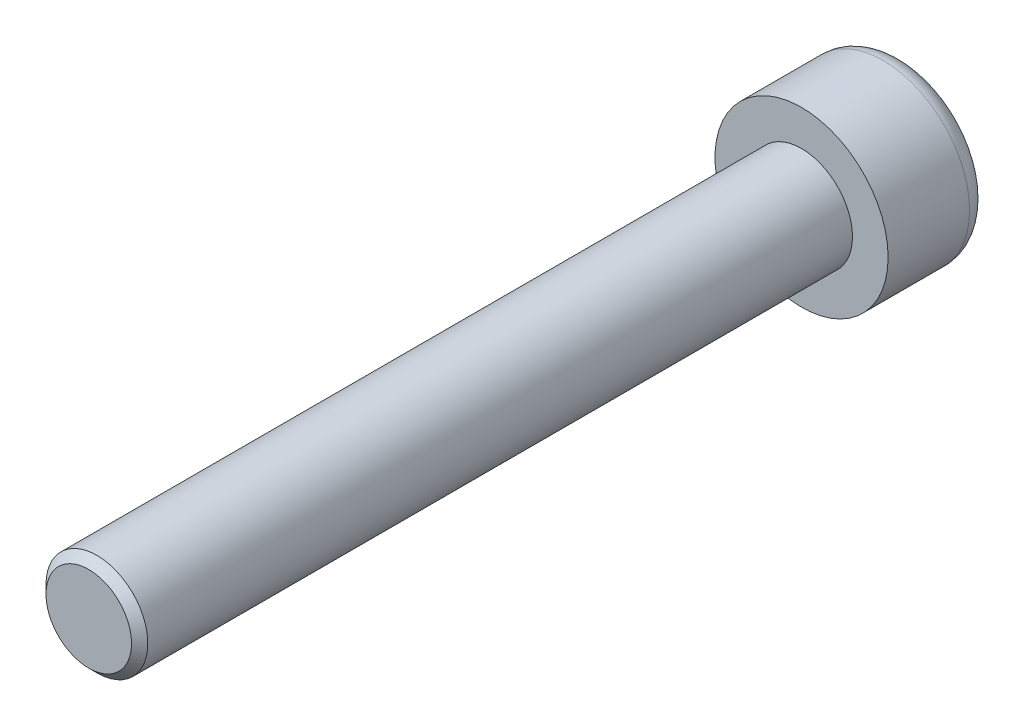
ISO-10303-21;
HEADER;
FILE_DESCRIPTION(('STEP AP214'),'2;1');
FILE_NAME('part.step','',(''),(''),'','','');
FILE_SCHEMA(('AUTOMOTIVE_DESIGN { 1 0 10303 214 1 1 1 1 }'));
ENDSEC;
DATA;
#1=APPLICATION_CONTEXT('core data for automotive mechanical design processes');
#2=APPLICATION_PROTOCOL_DEFINITION('international standard','automotive_design',2000,#1);
#3=PRODUCT_CONTEXT('',#1,'mechanical');
#4=PRODUCT('Part','Part','',(#3));
#5=PRODUCT_RELATED_PRODUCT_CATEGORY('part','',(#4));
#6=PRODUCT_DEFINITION_FORMATION('','',#4);
#7=PRODUCT_DEFINITION_CONTEXT('part definition',#1,'design');
#8=PRODUCT_DEFINITION('design','',#6,#7);
#9=PRODUCT_DEFINITION_SHAPE('','',#8);
#10=(LENGTH_UNIT() NAMED_UNIT(*) SI_UNIT(.MILLI.,.METRE.));
#11=(NAMED_UNIT(*) PLANE_ANGLE_UNIT() SI_UNIT($,.RADIAN.));
#12=(NAMED_UNIT(*) SI_UNIT($,.STERADIAN.) SOLID_ANGLE_UNIT());
#13=UNCERTAINTY_MEASURE_WITH_UNIT(LENGTH_MEASURE(1.E-05),#10,'distance_accuracy_value','');
#14=(GEOMETRIC_REPRESENTATION_CONTEXT(3) GLOBAL_UNCERTAINTY_ASSIGNED_CONTEXT((#13)) GLOBAL_UNIT_ASSIGNED_CONTEXT((#10,
#11,#12)) REPRESENTATION_CONTEXT('',''));
#15=CARTESIAN_POINT('',(0.,0.,0.));
#16=DIRECTION('',(0.,0.,1.));
#17=DIRECTION('',(1.,0.,0.));
#18=AXIS2_PLACEMENT_3D('',#15,#16,#17);
#19=CARTESIAN_POINT('',(0.,0.,5.));
#20=DIRECTION('',(0.,0.,1.));
#21=DIRECTION('',(1.,0.,0.));
#22=AXIS2_PLACEMENT_3D('',#19,#20,#21);
#23=PLANE('',#22);
#24=CARTESIAN_POINT('',(0.,0.,5.));
#25=DIRECTION('',(0.,0.,1.));
#26=DIRECTION('',(1.,0.,0.));
#27=AXIS2_PLACEMENT_3D('',#24,#25,#26);
#28=CIRCLE('',#27,4.25);
#29=CARTESIAN_POINT('',(4.25,0.,5.));
#30=VERTEX_POINT('',#29);
#31=EDGE_CURVE('E136',#30,#30,#28,.T.);
#32=ORIENTED_EDGE('',*,*,#31,.T.);
#33=EDGE_LOOP('',(#32));
#34=FACE_BOUND('',#33,.T.);
#35=CARTESIAN_POINT('',(0.,0.,5.));
#36=DIRECTION('',(0.,0.,1.));
#37=DIRECTION('',(1.,0.,0.));
#38=AXIS2_PLACEMENT_3D('',#35,#36,#37);
#39=CIRCLE('',#38,2.5);
#40=CARTESIAN_POINT('',(2.5,0.,5.));
#41=VERTEX_POINT('',#40);
#42=EDGE_CURVE('E195',#41,#41,#39,.T.);
#43=ORIENTED_EDGE('',*,*,#42,.F.);
#44=EDGE_LOOP('',(#43));
#45=FACE_BOUND('',#44,.T.);
#46=ADVANCED_FACE('F34',(#34,#45),#23,.T.);
#47=CARTESIAN_POINT('',(0.,0.,5.));
#48=DIRECTION('',(0.,0.,-1.));
#49=DIRECTION('',(-1.,0.,0.));
#50=AXIS2_PLACEMENT_3D('',#47,#48,#49);
#51=CYLINDRICAL_SURFACE('',#50,4.25);
#52=CARTESIAN_POINT('',(0.,0.,1.));
#53=DIRECTION('',(0.,0.,1.));
#54=DIRECTION('',(1.,0.,0.));
#55=AXIS2_PLACEMENT_3D('',#52,#53,#54);
#56=CIRCLE('',#55,4.25);
#57=CARTESIAN_POINT('',(4.25,0.,1.));
#58=VERTEX_POINT('',#57);
#59=EDGE_CURVE('E42',#58,#58,#56,.T.);
#60=ORIENTED_EDGE('',*,*,#59,.T.);
#61=EDGE_LOOP('',(#60));
#62=FACE_BOUND('',#61,.T.);
#63=ORIENTED_EDGE('',*,*,#31,.F.);
#64=EDGE_LOOP('',(#63));
#65=FACE_BOUND('',#64,.T.);
#66=ADVANCED_FACE('F36',(#62,#65),#51,.T.);
#67=CARTESIAN_POINT('',(0.,0.,0.));
#68=DIRECTION('',(0.,0.,1.));
#69=DIRECTION('',(1.,0.,0.));
#70=AXIS2_PLACEMENT_3D('',#67,#68,#69);
#71=PLANE('',#70);
#72=CARTESIAN_POINT('',(0.,0.,0.));
#73=DIRECTION('',(0.,0.,1.));
#74=DIRECTION('',(1.,0.,0.));
#75=AXIS2_PLACEMENT_3D('',#72,#73,#74);
#76=CIRCLE('',#75,3.25);
#77=CARTESIAN_POINT('',(3.25,0.,0.));
#78=VERTEX_POINT('',#77);
#79=EDGE_CURVE('E11',#78,#78,#76,.F.);
#80=ORIENTED_EDGE('',*,*,#79,.T.);
#81=EDGE_LOOP('',(#80));
#82=FACE_BOUND('',#81,.T.);
#83=DIRECTION('',(0.866025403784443,-0.499999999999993,0.));
#84=VECTOR('',#83,1.);
#85=CARTESIAN_POINT('',(0.,2.30940107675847,0.));
#86=LINE('',#85,#84);
#87=CARTESIAN_POINT('',(0.,2.30940107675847,0.));
#88=VERTEX_POINT('',#87);
#89=CARTESIAN_POINT('',(2.,1.15470053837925,0.));
#90=VERTEX_POINT('',#89);
#91=EDGE_CURVE('E103',#88,#90,#86,.T.);
#92=ORIENTED_EDGE('',*,*,#91,.F.);
#93=DIRECTION('',(0.866025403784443,0.499999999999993,0.));
#94=VECTOR('',#93,1.);
#95=CARTESIAN_POINT('',(0.,2.30940107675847,0.));
#96=LINE('',#95,#94);
#97=CARTESIAN_POINT('',(-2.,1.15470053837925,0.));
#98=VERTEX_POINT('',#97);
#99=EDGE_CURVE('E49',#98,#88,#96,.T.);
#100=ORIENTED_EDGE('',*,*,#99,.F.);
#101=DIRECTION('',(0.,1.,0.));
#102=VECTOR('',#101,1.);
#103=CARTESIAN_POINT('',(-2.,1.15470053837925,0.));
#104=LINE('',#103,#102);
#105=CARTESIAN_POINT('',(-2.,-1.15470053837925,0.));
#106=VERTEX_POINT('',#105);
#107=EDGE_CURVE('E118',#106,#98,#104,.T.);
#108=ORIENTED_EDGE('',*,*,#107,.F.);
#109=DIRECTION('',(-0.866025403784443,0.499999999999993,0.));
#110=VECTOR('',#109,1.);
#111=CARTESIAN_POINT('',(-2.,-1.15470053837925,0.));
#112=LINE('',#111,#110);
#113=CARTESIAN_POINT('',(0.,-2.30940107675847,0.));
#114=VERTEX_POINT('',#113);
#115=EDGE_CURVE('E112',#114,#106,#112,.T.);
#116=ORIENTED_EDGE('',*,*,#115,.F.);
#117=DIRECTION('',(-0.866025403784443,-0.499999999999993,0.));
#118=VECTOR('',#117,1.);
#119=CARTESIAN_POINT('',(2.,-1.15470053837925,0.));
#120=LINE('',#119,#118);
#121=CARTESIAN_POINT('',(2.,-1.15470053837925,0.));
#122=VERTEX_POINT('',#121);
#123=EDGE_CURVE('E110',#122,#114,#120,.T.);
#124=ORIENTED_EDGE('',*,*,#123,.F.);
#125=DIRECTION('',(0.,-1.,0.));
#126=VECTOR('',#125,1.);
#127=CARTESIAN_POINT('',(2.,1.15470053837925,0.));
#128=LINE('',#127,#126);
#129=EDGE_CURVE('E92',#90,#122,#128,.T.);
#130=ORIENTED_EDGE('',*,*,#129,.F.);
#131=EDGE_LOOP('',(#92,#100,#108,#116,#124,#130));
#132=FACE_BOUND('',#131,.T.);
#133=ADVANCED_FACE('F107',(#82,#132),#71,.F.);
#134=CARTESIAN_POINT('',(0.,2.30940107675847,3.125));
#135=DIRECTION('',(-0.499999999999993,0.866025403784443,0.));
#136=DIRECTION('',(-0.866025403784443,-0.499999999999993,0.));
#137=AXIS2_PLACEMENT_3D('',#134,#135,#136);
#138=PLANE('',#137);
#139=ORIENTED_EDGE('',*,*,#99,.T.);
#140=DIRECTION('',(0.,0.,-1.));
#141=VECTOR('',#140,1.);
#142=CARTESIAN_POINT('',(0.,2.30940107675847,3.125));
#143=LINE('',#142,#141);
#144=CARTESIAN_POINT('',(0.,2.30940107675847,3.125));
#145=VERTEX_POINT('',#144);
#146=EDGE_CURVE('E100',#145,#88,#143,.T.);
#147=ORIENTED_EDGE('',*,*,#146,.F.);
#148=DIRECTION('',(0.866025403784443,0.499999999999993,0.));
#149=VECTOR('',#148,1.);
#150=CARTESIAN_POINT('',(0.,2.30940107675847,3.125));
#151=LINE('',#150,#149);
#152=CARTESIAN_POINT('',(-2.,1.15470053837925,3.125));
#153=VERTEX_POINT('',#152);
#154=EDGE_CURVE('E120',#153,#145,#151,.T.);
#155=ORIENTED_EDGE('',*,*,#154,.F.);
#156=DIRECTION('',(0.,0.,-1.));
#157=VECTOR('',#156,1.);
#158=CARTESIAN_POINT('',(-2.,1.15470053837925,3.125));
#159=LINE('',#158,#157);
#160=EDGE_CURVE('E56',#153,#98,#159,.T.);
#161=ORIENTED_EDGE('',*,*,#160,.T.);
#162=EDGE_LOOP('',(#139,#147,#155,#161));
#163=FACE_BOUND('',#162,.T.);
#164=ADVANCED_FACE('F174',(#163),#138,.F.);
#165=CARTESIAN_POINT('',(-2.,1.15470053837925,3.125));
#166=DIRECTION('',(-1.,0.,0.));
#167=DIRECTION('',(0.,0.,1.));
#168=AXIS2_PLACEMENT_3D('',#165,#166,#167);
#169=PLANE('',#168);
#170=ORIENTED_EDGE('',*,*,#107,.T.);
#171=ORIENTED_EDGE('',*,*,#160,.F.);
#172=DIRECTION('',(0.,1.,0.));
#173=VECTOR('',#172,1.);
#174=CARTESIAN_POINT('',(-2.,1.15470053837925,3.125));
#175=LINE('',#174,#173);
#176=CARTESIAN_POINT('',(-2.,-1.15470053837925,3.125));
#177=VERTEX_POINT('',#176);
#178=EDGE_CURVE('E132',#177,#153,#175,.T.);
#179=ORIENTED_EDGE('',*,*,#178,.F.);
#180=DIRECTION('',(0.,0.,-1.));
#181=VECTOR('',#180,1.);
#182=CARTESIAN_POINT('',(-2.,-1.15470053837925,3.125));
#183=LINE('',#182,#181);
#184=EDGE_CURVE('E137',#177,#106,#183,.T.);
#185=ORIENTED_EDGE('',*,*,#184,.T.);
#186=EDGE_LOOP('',(#170,#171,#179,#185));
#187=FACE_BOUND('',#186,.T.);
#188=ADVANCED_FACE('F178',(#187),#169,.F.);
#189=CARTESIAN_POINT('',(-2.,-1.15470053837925,3.125));
#190=DIRECTION('',(-0.499999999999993,-0.866025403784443,0.));
#191=DIRECTION('',(0.866025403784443,-0.499999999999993,0.));
#192=AXIS2_PLACEMENT_3D('',#189,#190,#191);
#193=PLANE('',#192);
#194=ORIENTED_EDGE('',*,*,#115,.T.);
#195=ORIENTED_EDGE('',*,*,#184,.F.);
#196=DIRECTION('',(-0.866025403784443,0.499999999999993,0.));
#197=VECTOR('',#196,1.);
#198=CARTESIAN_POINT('',(-2.,-1.15470053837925,3.125));
#199=LINE('',#198,#197);
#200=CARTESIAN_POINT('',(0.,-2.30940107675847,3.125));
#201=VERTEX_POINT('',#200);
#202=EDGE_CURVE('E129',#201,#177,#199,.T.);
#203=ORIENTED_EDGE('',*,*,#202,.F.);
#204=DIRECTION('',(0.,0.,-1.));
#205=VECTOR('',#204,1.);
#206=CARTESIAN_POINT('',(0.,-2.30940107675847,3.125));
#207=LINE('',#206,#205);
#208=EDGE_CURVE('E139',#201,#114,#207,.T.);
#209=ORIENTED_EDGE('',*,*,#208,.T.);
#210=EDGE_LOOP('',(#194,#195,#203,#209));
#211=FACE_BOUND('',#210,.T.);
#212=ADVANCED_FACE('F186',(#211),#193,.F.);
#213=CARTESIAN_POINT('',(2.,-1.15470053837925,3.125));
#214=DIRECTION('',(0.499999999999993,-0.866025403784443,0.));
#215=DIRECTION('',(0.866025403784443,0.499999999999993,0.));
#216=AXIS2_PLACEMENT_3D('',#213,#214,#215);
#217=PLANE('',#216);
#218=ORIENTED_EDGE('',*,*,#123,.T.);
#219=ORIENTED_EDGE('',*,*,#208,.F.);
#220=DIRECTION('',(-0.866025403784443,-0.499999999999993,0.));
#221=VECTOR('',#220,1.);
#222=CARTESIAN_POINT('',(2.,-1.15470053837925,3.125));
#223=LINE('',#222,#221);
#224=CARTESIAN_POINT('',(2.,-1.15470053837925,3.125));
#225=VERTEX_POINT('',#224);
#226=EDGE_CURVE('E126',#225,#201,#223,.T.);
#227=ORIENTED_EDGE('',*,*,#226,.F.);
#228=DIRECTION('',(0.,0.,-1.));
#229=VECTOR('',#228,1.);
#230=CARTESIAN_POINT('',(2.,-1.15470053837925,3.125));
#231=LINE('',#230,#229);
#232=EDGE_CURVE('E99',#225,#122,#231,.T.);
#233=ORIENTED_EDGE('',*,*,#232,.T.);
#234=EDGE_LOOP('',(#218,#219,#227,#233));
#235=FACE_BOUND('',#234,.T.);
#236=ADVANCED_FACE('F183',(#235),#217,.F.);
#237=CARTESIAN_POINT('',(2.,1.15470053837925,3.125));
#238=DIRECTION('',(1.,0.,0.));
#239=DIRECTION('',(0.,0.,-1.));
#240=AXIS2_PLACEMENT_3D('',#237,#238,#239);
#241=PLANE('',#240);
#242=ORIENTED_EDGE('',*,*,#129,.T.);
#243=ORIENTED_EDGE('',*,*,#232,.F.);
#244=DIRECTION('',(0.,-1.,0.));
#245=VECTOR('',#244,1.);
#246=CARTESIAN_POINT('',(2.,1.15470053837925,3.125));
#247=LINE('',#246,#245);
#248=CARTESIAN_POINT('',(2.,1.15470053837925,3.125));
#249=VERTEX_POINT('',#248);
#250=EDGE_CURVE('E95',#249,#225,#247,.T.);
#251=ORIENTED_EDGE('',*,*,#250,.F.);
#252=DIRECTION('',(0.,0.,-1.));
#253=VECTOR('',#252,1.);
#254=CARTESIAN_POINT('',(2.,1.15470053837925,3.125));
#255=LINE('',#254,#253);
#256=EDGE_CURVE('E88',#249,#90,#255,.T.);
#257=ORIENTED_EDGE('',*,*,#256,.T.);
#258=EDGE_LOOP('',(#242,#243,#251,#257));
#259=FACE_BOUND('',#258,.T.);
#260=ADVANCED_FACE('F90',(#259),#241,.F.);
#261=CARTESIAN_POINT('',(0.,2.30940107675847,3.125));
#262=DIRECTION('',(0.499999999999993,0.866025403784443,0.));
#263=DIRECTION('',(-0.866025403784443,0.499999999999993,0.));
#264=AXIS2_PLACEMENT_3D('',#261,#262,#263);
#265=PLANE('',#264);
#266=ORIENTED_EDGE('',*,*,#91,.T.);
#267=ORIENTED_EDGE('',*,*,#256,.F.);
#268=DIRECTION('',(0.866025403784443,-0.499999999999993,0.));
#269=VECTOR('',#268,1.);
#270=CARTESIAN_POINT('',(0.,2.30940107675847,3.125));
#271=LINE('',#270,#269);
#272=EDGE_CURVE('E123',#145,#249,#271,.T.);
#273=ORIENTED_EDGE('',*,*,#272,.F.);
#274=ORIENTED_EDGE('',*,*,#146,.T.);
#275=EDGE_LOOP('',(#266,#267,#273,#274));
#276=FACE_BOUND('',#275,.T.);
#277=ADVANCED_FACE('F104',(#276),#265,.F.);
#278=CARTESIAN_POINT('',(-2.,1.15470053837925,3.125));
#279=DIRECTION('',(0.,0.,1.));
#280=DIRECTION('',(1.,0.,0.));
#281=AXIS2_PLACEMENT_3D('',#278,#279,#280);
#282=PLANE('',#281);
#283=ORIENTED_EDGE('',*,*,#154,.T.);
#284=ORIENTED_EDGE('',*,*,#272,.T.);
#285=ORIENTED_EDGE('',*,*,#250,.T.);
#286=ORIENTED_EDGE('',*,*,#226,.T.);
#287=ORIENTED_EDGE('',*,*,#202,.T.);
#288=ORIENTED_EDGE('',*,*,#178,.T.);
#289=EDGE_LOOP('',(#283,#284,#285,#286,#287,#288));
#290=FACE_BOUND('',#289,.T.);
#291=ADVANCED_FACE('F152',(#290),#282,.F.);
#292=CARTESIAN_POINT('',(0.,0.,1.));
#293=DIRECTION('',(0.,0.,1.));
#294=DIRECTION('',(1.,0.,0.));
#295=AXIS2_PLACEMENT_3D('',#292,#293,#294);
#296=TOROIDAL_SURFACE('',#295,3.25,1.);
#297=ORIENTED_EDGE('',*,*,#79,.F.);
#298=EDGE_LOOP('',(#297));
#299=FACE_BOUND('',#298,.T.);
#300=ORIENTED_EDGE('',*,*,#59,.F.);
#301=EDGE_LOOP('',(#300));
#302=FACE_BOUND('',#301,.T.);
#303=ADVANCED_FACE('F149',(#299,#302),#296,.T.);
#304=CARTESIAN_POINT('',(0.,0.,40.));
#305=DIRECTION('',(0.,0.,-1.));
#306=DIRECTION('',(-1.,0.,0.));
#307=AXIS2_PLACEMENT_3D('',#304,#305,#306);
#308=CYLINDRICAL_SURFACE('',#307,2.5);
#309=CARTESIAN_POINT('',(0.,0.,39.6));
#310=DIRECTION('',(0.,0.,-1.));
#311=DIRECTION('',(-1.,0.,0.));
#312=AXIS2_PLACEMENT_3D('',#309,#310,#311);
#313=CIRCLE('',#312,2.5);
#314=CARTESIAN_POINT('',(-2.5,0.,39.6));
#315=VERTEX_POINT('',#314);
#316=EDGE_CURVE('E202',#315,#315,#313,.T.);
#317=ORIENTED_EDGE('',*,*,#316,.T.);
#318=EDGE_LOOP('',(#317));
#319=FACE_BOUND('',#318,.T.);
#320=ORIENTED_EDGE('',*,*,#42,.T.);
#321=EDGE_LOOP('',(#320));
#322=FACE_BOUND('',#321,.T.);
#323=ADVANCED_FACE('F151',(#319,#322),#308,.T.);
#324=CARTESIAN_POINT('',(0.,0.,40.));
#325=DIRECTION('',(0.,0.,-1.));
#326=DIRECTION('',(-1.,0.,0.));
#327=AXIS2_PLACEMENT_3D('',#324,#325,#326);
#328=CONICAL_SURFACE('',#327,2.1,0.785398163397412);
#329=ORIENTED_EDGE('',*,*,#316,.F.);
#330=EDGE_LOOP('',(#329));
#331=FACE_BOUND('',#330,.T.);
#332=CARTESIAN_POINT('',(0.,0.,40.));
#333=DIRECTION('',(0.,0.,-1.));
#334=DIRECTION('',(-1.,0.,0.));
#335=AXIS2_PLACEMENT_3D('',#332,#333,#334);
#336=CIRCLE('',#335,2.1);
#337=CARTESIAN_POINT('',(-2.1,0.,40.));
#338=VERTEX_POINT('',#337);
#339=EDGE_CURVE('E197',#338,#338,#336,.T.);
#340=ORIENTED_EDGE('',*,*,#339,.T.);
#341=EDGE_LOOP('',(#340));
#342=FACE_BOUND('',#341,.T.);
#343=ADVANCED_FACE('F159',(#331,#342),#328,.T.);
#344=CARTESIAN_POINT('',(0.,0.,40.));
#345=DIRECTION('',(0.,0.,1.));
#346=DIRECTION('',(1.,0.,0.));
#347=AXIS2_PLACEMENT_3D('',#344,#345,#346);
#348=PLANE('',#347);
#349=ORIENTED_EDGE('',*,*,#339,.F.);
#350=EDGE_LOOP('',(#349));
#351=FACE_BOUND('',#350,.T.);
#352=ADVANCED_FACE('F209',(#351),#348,.T.);
#353=CLOSED_SHELL('',(#46,#66,#133,#164,#188,#212,#236,#260,#277,#291,#303,#323,#343,#352));
#354=MANIFOLD_SOLID_BREP('B2',#353);
#355=ADVANCED_BREP_SHAPE_REPRESENTATION('',(#18,#354),#14);
#356=SHAPE_DEFINITION_REPRESENTATION(#9,#355);
ENDSEC;
END-ISO-10303-21;
